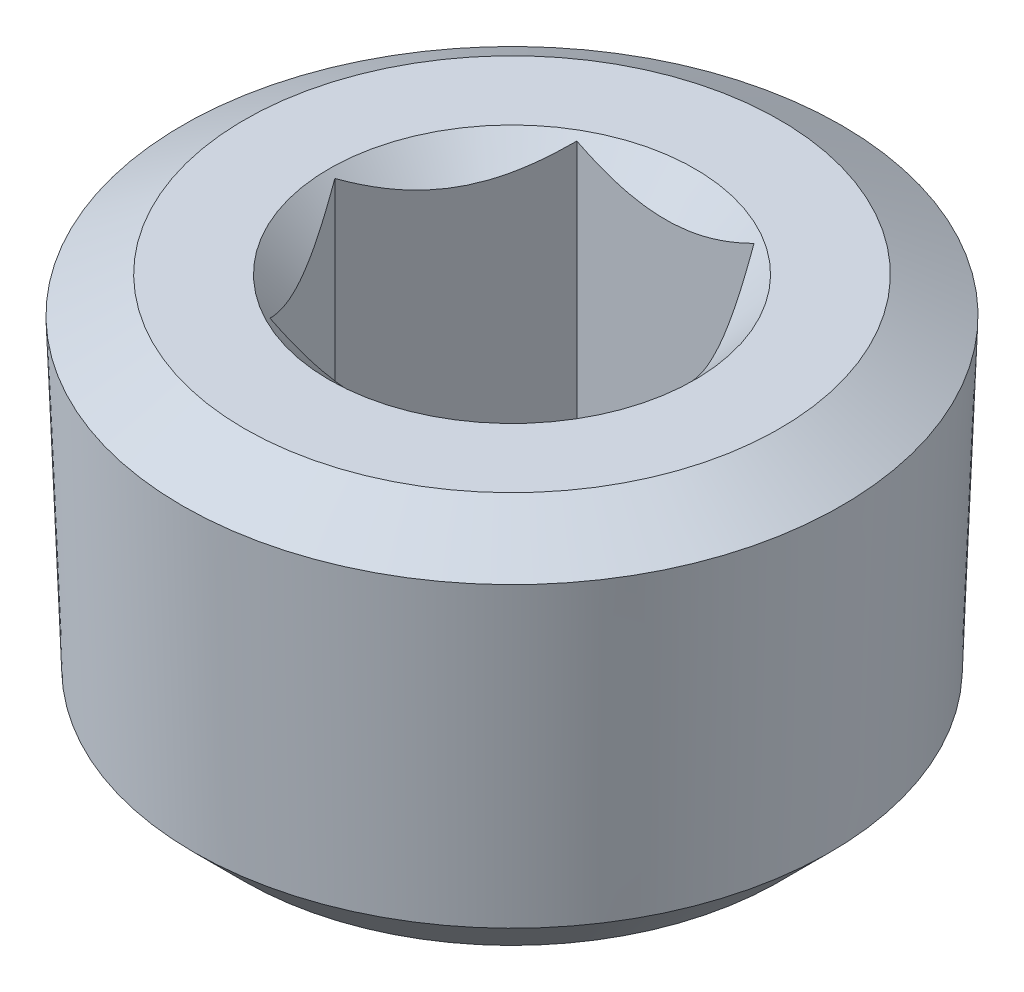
from build123d import *

# Parameters (mm, degrees)
CUT_EXTRUDE1_START = -6.858
CUT_EXTRUDE1_DEPTH = 6.71095


with BuildPart() as part:
    # Sketch2 → Revolve1 (revolve)
    with BuildSketch(Plane.XY, mode=Mode.PRIVATE) as revolve1_sk:
        Polygon((0, 0), (-6.932080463, 0), (-8.538682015, -0.927571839), (-8.250134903, -8.841945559), (-6.932080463, -10.16), (0, -10.16), align=None)
    revolve(revolve1_sk.sketch.rotate(Axis((0, 10.744282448, 0), (0, -1, 0)), 270), axis=Axis((0, 10.744282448, 0), (0, -1, 0)))

    # Sketch3 → Cut-Revolve1 (revolve, cut)
    with BuildSketch(Plane.XY, mode=Mode.PRIVATE) as cut_revolve1_sk:
        Polygon((0, 0), (-4.7371, 0), (-3.9751, -0.762), (-3.9751, -6.858), (-2.706919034, -7.62), (0, -7.62), align=None)
    revolve(cut_revolve1_sk.sketch.rotate(Axis((0, 2.934222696, 0), (0, -1, 0)), 270), axis=Axis((0, 2.934222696, 0), (0, -1, 0)), mode=Mode.SUBTRACT)

    # Sketch4 → Cut-Extrude1 (cut)
    with BuildSketch(Plane(origin=(0, 0, 0), x_dir=(1, 0, 0), z_dir=(0, 1, 0)).offset(CUT_EXTRUDE1_START)):
        Polygon((-2.295025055, -3.9751), (2.295025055, -3.9751), (4.59005011, 0), (2.295025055, 3.9751), (-2.295025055, 3.9751), (-4.59005011, 0), align=None)
    extrude(amount=CUT_EXTRUDE1_DEPTH, mode=Mode.SUBTRACT)


solid = part.part
